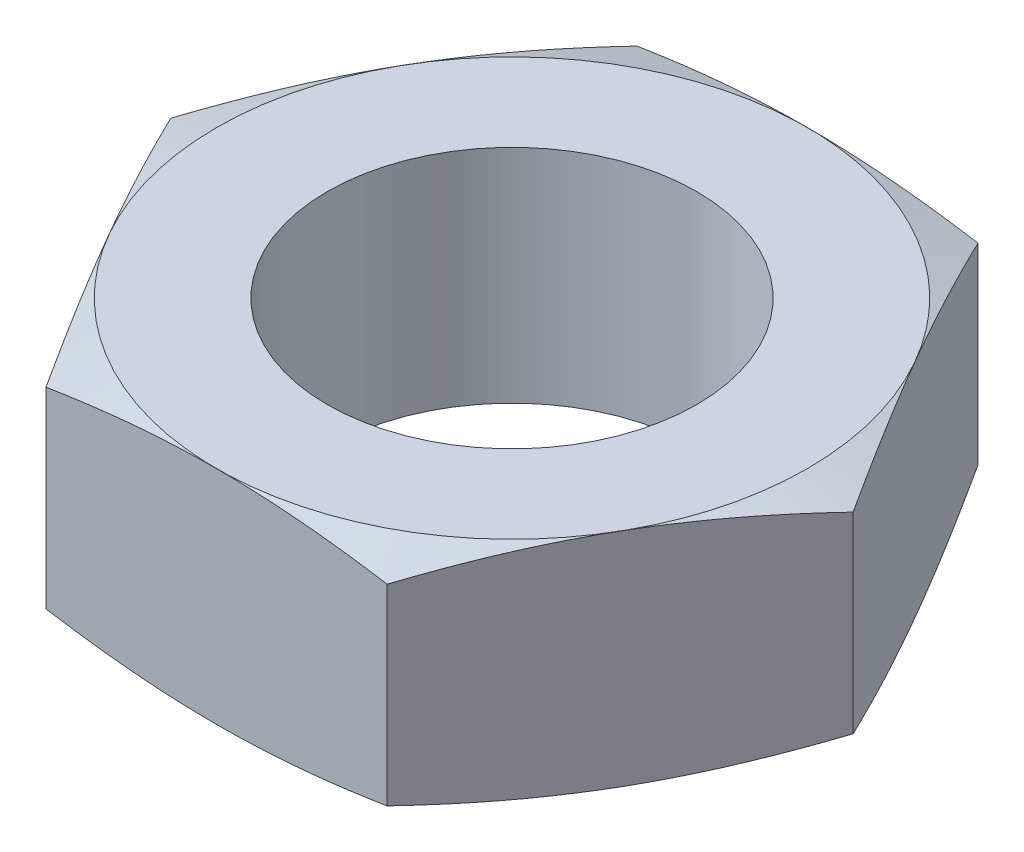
ISO-10303-21;
HEADER;
FILE_DESCRIPTION(('STEP AP214'),'2;1');
FILE_NAME('part.step','',(''),(''),'','','');
FILE_SCHEMA(('AUTOMOTIVE_DESIGN { 1 0 10303 214 1 1 1 1 }'));
ENDSEC;
DATA;
#1=APPLICATION_CONTEXT('core data for automotive mechanical design processes');
#2=APPLICATION_PROTOCOL_DEFINITION('international standard','automotive_design',2000,#1);
#3=PRODUCT_CONTEXT('',#1,'mechanical');
#4=PRODUCT('Part','Part','',(#3));
#5=PRODUCT_RELATED_PRODUCT_CATEGORY('part','',(#4));
#6=PRODUCT_DEFINITION_FORMATION('','',#4);
#7=PRODUCT_DEFINITION_CONTEXT('part definition',#1,'design');
#8=PRODUCT_DEFINITION('design','',#6,#7);
#9=PRODUCT_DEFINITION_SHAPE('','',#8);
#10=(LENGTH_UNIT() NAMED_UNIT(*) SI_UNIT(.MILLI.,.METRE.));
#11=(NAMED_UNIT(*) PLANE_ANGLE_UNIT() SI_UNIT($,.RADIAN.));
#12=(NAMED_UNIT(*) SI_UNIT($,.STERADIAN.) SOLID_ANGLE_UNIT());
#13=UNCERTAINTY_MEASURE_WITH_UNIT(LENGTH_MEASURE(1.E-05),#10,'distance_accuracy_value','');
#14=(GEOMETRIC_REPRESENTATION_CONTEXT(3) GLOBAL_UNCERTAINTY_ASSIGNED_CONTEXT((#13)) GLOBAL_UNIT_ASSIGNED_CONTEXT((#10,
#11,#12)) REPRESENTATION_CONTEXT('',''));
#15=CARTESIAN_POINT('',(0.,0.,0.));
#16=DIRECTION('',(0.,0.,1.));
#17=DIRECTION('',(1.,0.,0.));
#18=AXIS2_PLACEMENT_3D('',#15,#16,#17);
#19=CARTESIAN_POINT('',(-7.33234841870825,4.7625,0.));
#20=DIRECTION('',(0.,1.,0.));
#21=DIRECTION('',(0.,0.,1.));
#22=AXIS2_PLACEMENT_3D('',#19,#20,#21);
#23=PLANE('',#22);
#24=CARTESIAN_POINT('',(0.,4.76249999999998,0.));
#25=DIRECTION('',(0.,-1.,0.));
#26=DIRECTION('',(1.,0.,0.));
#27=AXIS2_PLACEMENT_3D('',#24,#25,#26);
#28=CIRCLE('',#27,6.34936841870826);
#29=CARTESIAN_POINT('',(6.34936841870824,4.7625,0.));
#30=VERTEX_POINT('',#29);
#31=EDGE_CURVE('E105',#30,#30,#28,.T.);
#32=ORIENTED_EDGE('',*,*,#31,.F.);
#33=EDGE_LOOP('',(#32));
#34=FACE_BOUND('',#33,.T.);
#35=CARTESIAN_POINT('',(0.,4.7625,0.));
#36=DIRECTION('',(0.,1.,0.));
#37=DIRECTION('',(0.,0.,1.));
#38=AXIS2_PLACEMENT_3D('',#35,#36,#37);
#39=CIRCLE('',#38,3.96875);
#40=CARTESIAN_POINT('',(0.,4.7625,-3.96875));
#41=VERTEX_POINT('',#40);
#42=EDGE_CURVE('E206',#41,#41,#39,.T.);
#43=ORIENTED_EDGE('',*,*,#42,.F.);
#44=EDGE_LOOP('',(#43));
#45=FACE_BOUND('',#44,.T.);
#46=ADVANCED_FACE('F32',(#34,#45),#23,.T.);
#47=CARTESIAN_POINT('',(-7.33234841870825,0.,0.));
#48=DIRECTION('',(0.,1.,0.));
#49=DIRECTION('',(0.,0.,1.));
#50=AXIS2_PLACEMENT_3D('',#47,#48,#49);
#51=PLANE('',#50);
#52=CARTESIAN_POINT('',(0.,0.,0.));
#53=DIRECTION('',(0.,-1.,0.));
#54=DIRECTION('',(1.,0.,0.));
#55=AXIS2_PLACEMENT_3D('',#52,#53,#54);
#56=CIRCLE('',#55,6.34936841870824);
#57=CARTESIAN_POINT('',(6.34936841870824,0.,0.));
#58=VERTEX_POINT('',#57);
#59=EDGE_CURVE('E234',#58,#58,#56,.T.);
#60=ORIENTED_EDGE('',*,*,#59,.T.);
#61=EDGE_LOOP('',(#60));
#62=FACE_BOUND('',#61,.T.);
#63=CARTESIAN_POINT('',(0.,0.,0.));
#64=DIRECTION('',(0.,1.,0.));
#65=DIRECTION('',(0.,0.,1.));
#66=AXIS2_PLACEMENT_3D('',#63,#64,#65);
#67=CIRCLE('',#66,3.96875);
#68=CARTESIAN_POINT('',(0.,0.,-3.96875));
#69=VERTEX_POINT('',#68);
#70=EDGE_CURVE('E205',#69,#69,#67,.T.);
#71=ORIENTED_EDGE('',*,*,#70,.T.);
#72=EDGE_LOOP('',(#71));
#73=FACE_BOUND('',#72,.T.);
#74=ADVANCED_FACE('F135',(#62,#73),#51,.F.);
#75=CARTESIAN_POINT('',(-3.66617420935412,4.7625,-6.35000000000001));
#76=DIRECTION('',(0.866025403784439,0.,0.5));
#77=DIRECTION('',(0.5,0.,-0.866025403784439));
#78=AXIS2_PLACEMENT_3D('',#75,#76,#77);
#79=PLANE('',#78);
#80=DIRECTION('',(0.,-1.,0.));
#81=VECTOR('',#80,1.);
#82=CARTESIAN_POINT('',(-7.33234841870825,4.7625,0.));
#83=LINE('',#82,#81);
#84=CARTESIAN_POINT('',(-7.33234841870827,4.44499999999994,0.));
#85=VERTEX_POINT('',#84);
#86=CARTESIAN_POINT('',(-7.33234841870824,0.317499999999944,0.));
#87=VERTEX_POINT('',#86);
#88=EDGE_CURVE('E119',#85,#87,#83,.T.);
#89=ORIENTED_EDGE('',*,*,#88,.F.);
#90=CARTESIAN_POINT('',(-7.33246388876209,4.44496270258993,0.000200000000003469));
#91=CARTESIAN_POINT('',(-7.1804349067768,4.49408731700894,-0.26312192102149));
#92=CARTESIAN_POINT('',(-7.02800846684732,4.53873297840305,-0.527132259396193));
#93=CARTESIAN_POINT('',(-6.72237428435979,4.61722964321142,-1.05650619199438));
#94=CARTESIAN_POINT('',(-6.56916612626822,4.65107412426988,-1.32187050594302));
#95=CARTESIAN_POINT('',(-6.26331249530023,4.70586252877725,-1.851624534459));
#96=CARTESIAN_POINT('',(-6.1106713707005,4.72690094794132,-2.11600671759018));
#97=CARTESIAN_POINT('',(-5.80510720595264,4.75511568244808,-2.64525937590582));
#98=CARTESIAN_POINT('',(-5.65218425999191,4.76229600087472,-2.91012968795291));
#99=CARTESIAN_POINT('',(-5.34633836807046,4.76229600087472,-3.4398703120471));
#100=CARTESIAN_POINT('',(-5.19341542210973,4.75511568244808,-3.70474062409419));
#101=CARTESIAN_POINT('',(-4.88785125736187,4.72690094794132,-4.23399328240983));
#102=CARTESIAN_POINT('',(-4.73521013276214,4.70586252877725,-4.49837546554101));
#103=CARTESIAN_POINT('',(-4.42935650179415,4.65107412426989,-5.02812949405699));
#104=CARTESIAN_POINT('',(-4.27614834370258,4.61722964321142,-5.29349380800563));
#105=CARTESIAN_POINT('',(-3.97051416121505,4.53873297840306,-5.82286774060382));
#106=CARTESIAN_POINT('',(-3.81808772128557,4.49408731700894,-6.08687807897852));
#107=CARTESIAN_POINT('',(-3.66605873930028,4.44496270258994,-6.35020000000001));
#108=B_SPLINE_CURVE_WITH_KNOTS('',3,(#90,#91,#92,#93,#94,#95,#96,#97,#98,#99,#100,#101,#102,
#103,#104,#105,#106,#107),.UNSPECIFIED.,.F.,.F.,(4,2,2,2,2,2,2,2,4),(0.,0.924075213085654,
1.848707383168,2.76643127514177,3.68389003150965,4.60134878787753,5.51907267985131,
6.44370484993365,7.3677800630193),.UNSPECIFIED.);
#109=CARTESIAN_POINT('',(-3.66617420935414,4.44499999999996,-6.35000000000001));
#110=VERTEX_POINT('',#109);
#111=EDGE_CURVE('E177',#85,#110,#108,.T.);
#112=ORIENTED_EDGE('',*,*,#111,.T.);
#113=DIRECTION('',(0.,-1.,0.));
#114=VECTOR('',#113,1.);
#115=CARTESIAN_POINT('',(-3.66617420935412,4.7625,-6.35000000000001));
#116=LINE('',#115,#114);
#117=CARTESIAN_POINT('',(-3.66617420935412,0.317500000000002,-6.35000000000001));
#118=VERTEX_POINT('',#117);
#119=EDGE_CURVE('E60',#110,#118,#116,.T.);
#120=ORIENTED_EDGE('',*,*,#119,.T.);
#121=CARTESIAN_POINT('',(-3.66605873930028,0.317537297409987,-6.35020000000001));
#122=CARTESIAN_POINT('',(-3.81808772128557,0.268412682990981,-6.08687807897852));
#123=CARTESIAN_POINT('',(-3.97051416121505,0.223767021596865,-5.82286774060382));
#124=CARTESIAN_POINT('',(-4.27614834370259,0.145270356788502,-5.29349380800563));
#125=CARTESIAN_POINT('',(-4.42935650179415,0.111425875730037,-5.02812949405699));
#126=CARTESIAN_POINT('',(-4.73521013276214,0.0566374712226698,-4.49837546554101));
#127=CARTESIAN_POINT('',(-4.88785125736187,0.0355990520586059,-4.23399328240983));
#128=CARTESIAN_POINT('',(-5.19341542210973,0.0073843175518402,-3.70474062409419));
#129=CARTESIAN_POINT('',(-5.34633836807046,0.000203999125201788,-3.4398703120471));
#130=CARTESIAN_POINT('',(-5.65218425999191,0.000203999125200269,-2.91012968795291));
#131=CARTESIAN_POINT('',(-5.80510720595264,0.00738431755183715,-2.64525937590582));
#132=CARTESIAN_POINT('',(-6.1106713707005,0.0355990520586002,-2.11600671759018));
#133=CARTESIAN_POINT('',(-6.26331249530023,0.056637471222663,-1.851624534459));
#134=CARTESIAN_POINT('',(-6.56916612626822,0.111425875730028,-1.32187050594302));
#135=CARTESIAN_POINT('',(-6.72237428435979,0.145270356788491,-1.05650619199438));
#136=CARTESIAN_POINT('',(-7.02800846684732,0.223767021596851,-0.527132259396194));
#137=CARTESIAN_POINT('',(-7.1804349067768,0.268412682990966,-0.263121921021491));
#138=CARTESIAN_POINT('',(-7.33246388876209,0.317537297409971,0.000200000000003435));
#139=B_SPLINE_CURVE_WITH_KNOTS('',3,(#121,#122,#123,#124,#125,#126,#127,#128,#129,#130,#131,
#132,#133,#134,#135,#136,#137,#138),.UNSPECIFIED.,.F.,.F.,(4,2,2,2,2,2,2,2,4),(0.,
0.924075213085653,1.848707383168,2.76643127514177,3.68389003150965,4.60134878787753,
5.5190726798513,6.44370484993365,7.3677800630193),.UNSPECIFIED.);
#140=EDGE_CURVE('E196',#118,#87,#139,.T.);
#141=ORIENTED_EDGE('',*,*,#140,.T.);
#142=EDGE_LOOP('',(#89,#112,#120,#141));
#143=FACE_BOUND('',#142,.T.);
#144=ADVANCED_FACE('F34',(#143),#79,.F.);
#145=CARTESIAN_POINT('',(-7.33234841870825,4.7625,0.));
#146=DIRECTION('',(0.866025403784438,0.,-0.5));
#147=DIRECTION('',(-0.5,0.,-0.866025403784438));
#148=AXIS2_PLACEMENT_3D('',#145,#146,#147);
#149=PLANE('',#148);
#150=DIRECTION('',(0.,-1.,0.));
#151=VECTOR('',#150,1.);
#152=CARTESIAN_POINT('',(-3.66617420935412,4.7625,6.35000000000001));
#153=LINE('',#152,#151);
#154=CARTESIAN_POINT('',(-3.66617420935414,4.44499999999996,6.35000000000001));
#155=VERTEX_POINT('',#154);
#156=CARTESIAN_POINT('',(-3.6661742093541,0.317499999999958,6.35000000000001));
#157=VERTEX_POINT('',#156);
#158=EDGE_CURVE('E113',#155,#157,#153,.T.);
#159=ORIENTED_EDGE('',*,*,#158,.F.);
#160=CARTESIAN_POINT('',(-3.66605873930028,4.44496270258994,6.35020000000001));
#161=CARTESIAN_POINT('',(-3.81808772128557,4.49408731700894,6.08687807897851));
#162=CARTESIAN_POINT('',(-3.97051416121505,4.53873297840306,5.82286774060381));
#163=CARTESIAN_POINT('',(-4.27614834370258,4.61722964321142,5.29349380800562));
#164=CARTESIAN_POINT('',(-4.42935650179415,4.65107412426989,5.02812949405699));
#165=CARTESIAN_POINT('',(-4.73521013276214,4.70586252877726,4.49837546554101));
#166=CARTESIAN_POINT('',(-4.88785125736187,4.72690094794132,4.23399328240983));
#167=CARTESIAN_POINT('',(-5.19341542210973,4.75511568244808,3.70474062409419));
#168=CARTESIAN_POINT('',(-5.34633836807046,4.76229600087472,3.4398703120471));
#169=CARTESIAN_POINT('',(-5.65218425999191,4.76229600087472,2.91012968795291));
#170=CARTESIAN_POINT('',(-5.80510720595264,4.75511568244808,2.64525937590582));
#171=CARTESIAN_POINT('',(-6.11067137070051,4.72690094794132,2.11600671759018));
#172=CARTESIAN_POINT('',(-6.26331249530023,4.70586252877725,1.851624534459));
#173=CARTESIAN_POINT('',(-6.56916612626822,4.65107412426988,1.32187050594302));
#174=CARTESIAN_POINT('',(-6.72237428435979,4.61722964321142,1.05650619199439));
#175=CARTESIAN_POINT('',(-7.02800846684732,4.53873297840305,0.5271322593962));
#176=CARTESIAN_POINT('',(-7.1804349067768,4.49408731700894,0.263121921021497));
#177=CARTESIAN_POINT('',(-7.33246388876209,4.44496270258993,-0.000199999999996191));
#178=B_SPLINE_CURVE_WITH_KNOTS('',3,(#160,#161,#162,#163,#164,#165,#166,#167,#168,#169,#170,
#171,#172,#173,#174,#175,#176,#177),.UNSPECIFIED.,.F.,.F.,(4,2,2,2,2,2,2,2,4),(0.,
0.924075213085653,1.848707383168,2.76643127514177,3.68389003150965,4.60134878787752,
5.5190726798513,6.44370484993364,7.36778006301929),.UNSPECIFIED.);
#179=EDGE_CURVE('E172',#155,#85,#178,.T.);
#180=ORIENTED_EDGE('',*,*,#179,.T.);
#181=ORIENTED_EDGE('',*,*,#88,.T.);
#182=CARTESIAN_POINT('',(-7.33246388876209,0.317537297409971,-0.000199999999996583));
#183=CARTESIAN_POINT('',(-7.1804349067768,0.268412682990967,0.263121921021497));
#184=CARTESIAN_POINT('',(-7.02800846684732,0.223767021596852,0.5271322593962));
#185=CARTESIAN_POINT('',(-6.72237428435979,0.145270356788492,1.05650619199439));
#186=CARTESIAN_POINT('',(-6.56916612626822,0.111425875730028,1.32187050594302));
#187=CARTESIAN_POINT('',(-6.26331249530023,0.0566374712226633,1.851624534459));
#188=CARTESIAN_POINT('',(-6.1106713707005,0.0355990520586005,2.11600671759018));
#189=CARTESIAN_POINT('',(-5.80510720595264,0.00738431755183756,2.64525937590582));
#190=CARTESIAN_POINT('',(-5.65218425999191,0.000203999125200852,2.91012968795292));
#191=CARTESIAN_POINT('',(-5.34633836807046,0.000203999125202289,3.4398703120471));
#192=CARTESIAN_POINT('',(-5.19341542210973,0.00738431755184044,3.70474062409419));
#193=CARTESIAN_POINT('',(-4.88785125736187,0.0355990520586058,4.23399328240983));
#194=CARTESIAN_POINT('',(-4.73521013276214,0.0566374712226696,4.49837546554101));
#195=CARTESIAN_POINT('',(-4.42935650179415,0.111425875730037,5.02812949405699));
#196=CARTESIAN_POINT('',(-4.27614834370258,0.145270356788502,5.29349380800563));
#197=CARTESIAN_POINT('',(-3.97051416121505,0.223767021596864,5.82286774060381));
#198=CARTESIAN_POINT('',(-3.81808772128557,0.268412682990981,6.08687807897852));
#199=CARTESIAN_POINT('',(-3.66605873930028,0.317537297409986,6.35020000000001));
#200=B_SPLINE_CURVE_WITH_KNOTS('',3,(#182,#183,#184,#185,#186,#187,#188,#189,#190,#191,#192,
#193,#194,#195,#196,#197,#198,#199),.UNSPECIFIED.,.F.,.F.,(4,2,2,2,2,2,2,2,4),(0.,
0.924075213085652,1.848707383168,2.76643127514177,3.68389003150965,4.60134878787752,
5.5190726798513,6.44370484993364,7.36778006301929),.UNSPECIFIED.);
#201=EDGE_CURVE('E189',#87,#157,#200,.T.);
#202=ORIENTED_EDGE('',*,*,#201,.T.);
#203=EDGE_LOOP('',(#159,#180,#181,#202));
#204=FACE_BOUND('',#203,.T.);
#205=ADVANCED_FACE('F181',(#204),#149,.F.);
#206=CARTESIAN_POINT('',(-3.66617420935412,4.7625,6.35000000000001));
#207=DIRECTION('',(0.,0.,-1.));
#208=DIRECTION('',(-1.,0.,0.));
#209=AXIS2_PLACEMENT_3D('',#206,#207,#208);
#210=PLANE('',#209);
#211=DIRECTION('',(0.,-1.,0.));
#212=VECTOR('',#211,1.);
#213=CARTESIAN_POINT('',(3.66617420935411,4.7625,6.35000000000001));
#214=LINE('',#213,#212);
#215=CARTESIAN_POINT('',(3.66617420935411,4.44499999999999,6.35000000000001));
#216=VERTEX_POINT('',#215);
#217=CARTESIAN_POINT('',(3.66617420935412,0.317499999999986,6.35));
#218=VERTEX_POINT('',#217);
#219=EDGE_CURVE('E111',#216,#218,#214,.T.);
#220=ORIENTED_EDGE('',*,*,#219,.F.);
#221=CARTESIAN_POINT('',(-9.70088606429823,3.06837421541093,6.35000000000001));
#222=CARTESIAN_POINT('',(-9.41304842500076,3.1461404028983,6.35000000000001));
#223=CARTESIAN_POINT('',(-9.12495537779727,3.2229783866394,6.35000000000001));
#224=CARTESIAN_POINT('',(-8.54813073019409,3.3742894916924,6.35000000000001));
#225=CARTESIAN_POINT('',(-8.25939909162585,3.4487624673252,6.35000000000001));
#226=CARTESIAN_POINT('',(-7.68079126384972,3.59492990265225,6.35000000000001));
#227=CARTESIAN_POINT('',(-7.39091402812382,3.66662023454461,6.35000000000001));
#228=CARTESIAN_POINT('',(-6.81029635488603,3.8064136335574,6.35000000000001));
#229=CARTESIAN_POINT('',(-6.51955592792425,3.87451674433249,6.35000000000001));
#230=CARTESIAN_POINT('',(-5.94044694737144,4.00549584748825,6.35000000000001));
#231=CARTESIAN_POINT('',(-5.65209011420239,4.06842340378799,6.35000000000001));
#232=CARTESIAN_POINT('',(-5.07424781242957,4.18885352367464,6.35000000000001));
#233=CARTESIAN_POINT('',(-4.78476237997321,4.24635625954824,6.35000000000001));
#234=CARTESIAN_POINT('',(-4.20457649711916,4.35462283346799,6.35000000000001));
#235=CARTESIAN_POINT('',(-3.91387627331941,4.4053878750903,6.35000000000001));
#236=CARTESIAN_POINT('',(-3.33113753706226,4.4986533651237,6.35000000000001));
#237=CARTESIAN_POINT('',(-3.03909902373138,4.54115380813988,6.35000000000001));
#238=CARTESIAN_POINT('',(-2.45219008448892,4.61640389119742,6.35000000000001));
#239=CARTESIAN_POINT('',(-2.15731284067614,4.64910115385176,6.35000000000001));
#240=CARTESIAN_POINT('',(-1.56648565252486,4.70279155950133,6.35000000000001));
#241=CARTESIAN_POINT('',(-1.27053574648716,4.72378511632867,6.35000000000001));
#242=CARTESIAN_POINT('',(-0.678189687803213,4.75279679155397,6.35000000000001));
#243=CARTESIAN_POINT('',(-0.381793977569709,4.76082375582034,6.35000000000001));
#244=CARTESIAN_POINT('',(0.211056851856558,4.76339756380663,6.35000000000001));
#245=CARTESIAN_POINT('',(0.507511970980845,4.7579444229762,6.35000000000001));
#246=CARTESIAN_POINT('',(1.1014139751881,4.7338603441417,6.35000000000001));
#247=CARTESIAN_POINT('',(1.3988580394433,4.71516126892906,6.35000000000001));
#248=CARTESIAN_POINT('',(1.99272960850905,4.66567425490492,6.35000000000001));
#249=CARTESIAN_POINT('',(2.28915707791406,4.6348858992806,6.35000000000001));
#250=CARTESIAN_POINT('',(2.88100929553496,4.56281297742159,6.35000000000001));
#251=CARTESIAN_POINT('',(3.17643276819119,4.52151810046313,6.35000000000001));
#252=CARTESIAN_POINT('',(3.76591108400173,4.4301940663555,6.35000000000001));
#253=CARTESIAN_POINT('',(4.05996592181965,4.38016487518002,6.35000000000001));
#254=CARTESIAN_POINT('',(4.62749518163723,4.27651251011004,6.35000000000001));
#255=CARTESIAN_POINT('',(4.90105296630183,4.2233411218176,6.35000000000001));
#256=CARTESIAN_POINT('',(5.44713820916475,4.1119237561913,6.35000000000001));
#257=CARTESIAN_POINT('',(5.71966562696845,4.05367758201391,6.35000000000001));
#258=CARTESIAN_POINT('',(6.26383583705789,3.93305170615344,6.35000000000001));
#259=CARTESIAN_POINT('',(6.53547851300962,3.87067148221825,6.35000000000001));
#260=CARTESIAN_POINT('',(7.0779702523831,3.74254270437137,6.35000000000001));
#261=CARTESIAN_POINT('',(7.34881930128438,3.6767940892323,6.35000000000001));
#262=CARTESIAN_POINT('',(8.16049374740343,3.47541335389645,6.35000000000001));
#263=CARTESIAN_POINT('',(8.70030038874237,3.33567946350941,6.35000000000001));
#264=CARTESIAN_POINT('',(9.77787882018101,3.04882513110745,6.35000000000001));
#265=CARTESIAN_POINT('',(10.3156507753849,2.90170530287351,6.35000000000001));
#266=CARTESIAN_POINT('',(11.3823067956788,2.6043379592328,6.35000000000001));
#267=CARTESIAN_POINT('',(11.911210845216,2.45416193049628,6.35000000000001));
#268=CARTESIAN_POINT('',(12.9679759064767,2.15014426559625,6.35000000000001));
#269=CARTESIAN_POINT('',(13.495836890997,1.99630253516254,6.35000000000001));
#270=CARTESIAN_POINT('',(14.5498743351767,1.68616937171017,6.35000000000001));
#271=CARTESIAN_POINT('',(15.0760521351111,1.52988248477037,6.35000000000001));
#272=CARTESIAN_POINT('',(16.1277584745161,1.21522530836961,6.35000000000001));
#273=CARTESIAN_POINT('',(16.6532870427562,1.05685511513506,6.35000000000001));
#274=CARTESIAN_POINT('',(17.1785887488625,0.897744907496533,6.35000000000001));
#275=B_SPLINE_CURVE_WITH_KNOTS('',3,(#221,#222,#223,#224,#225,#226,#227,#228,#229,#230,#231,
#232,#233,#234,#235,#236,#237,#238,#239,#240,#241,#242,#243,#244,#245,#246,#247,#248,#249,#250,
#251,#252,#253,#254,#255,#256,#257,#258,#259,#260,#261,#262,#263,#264,#265,#266,#267,#268,#269,
#270,#271,#272,#273,#274),.UNSPECIFIED.,.F.,.F.,(4,2,2,2,2,2,2,2,2,2,2,2,2,2,2,2,2,2,2,2,2,2,2,
2,2,2,4),(0.,0.894478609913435,1.78901221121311,2.68482566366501,3.58062821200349,
4.46601652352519,5.35137670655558,6.23657852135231,7.12178091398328,8.01163185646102,
8.90145133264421,9.79066351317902,10.6798746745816,11.5736934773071,12.4675430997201,
13.3622733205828,14.2570070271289,15.0929822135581,15.9289898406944,16.7651032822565,
17.6012319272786,19.2739384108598,20.9465061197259,22.5959210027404,24.2453783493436,
25.8920666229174,27.5386791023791),.UNSPECIFIED.);
#276=EDGE_CURVE('E93',#216,#155,#275,.F.);
#277=ORIENTED_EDGE('',*,*,#276,.T.);
#278=ORIENTED_EDGE('',*,*,#158,.T.);
#279=CARTESIAN_POINT('',(-9.70088606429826,1.69412578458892,6.35000000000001));
#280=CARTESIAN_POINT('',(-9.41304842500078,1.61635959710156,6.35000000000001));
#281=CARTESIAN_POINT('',(-9.1249553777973,1.53952161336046,6.35000000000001));
#282=CARTESIAN_POINT('',(-8.54813073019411,1.38821050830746,6.35000000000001));
#283=CARTESIAN_POINT('',(-8.25939909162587,1.31373753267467,6.35000000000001));
#284=CARTESIAN_POINT('',(-7.68079126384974,1.16757009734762,6.35000000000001));
#285=CARTESIAN_POINT('',(-7.39091402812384,1.09587976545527,6.35000000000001));
#286=CARTESIAN_POINT('',(-6.81029635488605,0.956086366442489,6.35000000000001));
#287=CARTESIAN_POINT('',(-6.51955592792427,0.887983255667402,6.35000000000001));
#288=CARTESIAN_POINT('',(-5.94044694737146,0.757004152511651,6.35000000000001));
#289=CARTESIAN_POINT('',(-5.65209011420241,0.694076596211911,6.35000000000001));
#290=CARTESIAN_POINT('',(-5.07424781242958,0.57364647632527,6.35000000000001));
#291=CARTESIAN_POINT('',(-4.78476237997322,0.516143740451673,6.35000000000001));
#292=CARTESIAN_POINT('',(-4.20457649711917,0.407877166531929,6.35000000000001));
#293=CARTESIAN_POINT('',(-3.91387627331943,0.357112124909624,6.35000000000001));
#294=CARTESIAN_POINT('',(-3.33113753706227,0.263846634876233,6.35000000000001));
#295=CARTESIAN_POINT('',(-3.03909902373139,0.221346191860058,6.35000000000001));
#296=CARTESIAN_POINT('',(-2.45219008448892,0.146096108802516,6.35000000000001));
#297=CARTESIAN_POINT('',(-2.15731284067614,0.113398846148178,6.35000000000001));
#298=CARTESIAN_POINT('',(-1.56648565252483,0.0597084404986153,6.35000000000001));
#299=CARTESIAN_POINT('',(-1.27053574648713,0.0387148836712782,6.35000000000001));
#300=CARTESIAN_POINT('',(-0.678189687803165,0.00970320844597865,6.35000000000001));
#301=CARTESIAN_POINT('',(-0.381793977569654,0.00167624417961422,6.35000000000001));
#302=CARTESIAN_POINT('',(0.211056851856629,-0.000897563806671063,6.35000000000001));
#303=CARTESIAN_POINT('',(0.507511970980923,0.00455557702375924,6.35000000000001));
#304=CARTESIAN_POINT('',(1.1014139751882,0.0286396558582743,6.35000000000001));
#305=CARTESIAN_POINT('',(1.39885803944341,0.0473387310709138,6.35000000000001));
#306=CARTESIAN_POINT('',(1.99272960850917,0.0968257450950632,6.35000000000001));
#307=CARTESIAN_POINT('',(2.28915707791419,0.127614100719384,6.35000000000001));
#308=CARTESIAN_POINT('',(2.8810092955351,0.199687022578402,6.35000000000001));
#309=CARTESIAN_POINT('',(3.17643276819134,0.240981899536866,6.35000000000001));
#310=CARTESIAN_POINT('',(3.76591108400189,0.3323059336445,6.35000000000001));
#311=CARTESIAN_POINT('',(4.05996592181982,0.382335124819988,6.35000000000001));
#312=CARTESIAN_POINT('',(4.62749518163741,0.485987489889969,6.35000000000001));
#313=CARTESIAN_POINT('',(4.90105296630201,0.539158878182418,6.35000000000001));
#314=CARTESIAN_POINT('',(5.44713820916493,0.650576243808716,6.35000000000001));
#315=CARTESIAN_POINT('',(5.71966562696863,0.708822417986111,6.35000000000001));
#316=CARTESIAN_POINT('',(6.26383583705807,0.829448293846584,6.35000000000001));
#317=CARTESIAN_POINT('',(6.5354785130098,0.89182851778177,6.35000000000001));
#318=CARTESIAN_POINT('',(7.07797025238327,1.01995729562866,6.35000000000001));
#319=CARTESIAN_POINT('',(7.34881930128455,1.08570591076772,6.35000000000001));
#320=CARTESIAN_POINT('',(8.1604937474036,1.28708664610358,6.35000000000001));
#321=CARTESIAN_POINT('',(8.70030038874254,1.42682053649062,6.35000000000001));
#322=CARTESIAN_POINT('',(9.77787882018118,1.71367486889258,6.35000000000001));
#323=CARTESIAN_POINT('',(10.3156507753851,1.86079469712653,6.35000000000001));
#324=CARTESIAN_POINT('',(11.382306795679,2.15816204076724,6.35000000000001));
#325=CARTESIAN_POINT('',(11.9112108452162,2.30833806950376,6.35000000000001));
#326=CARTESIAN_POINT('',(12.9679759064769,2.61235573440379,6.35000000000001));
#327=CARTESIAN_POINT('',(13.4958368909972,2.7661974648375,6.35000000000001));
#328=CARTESIAN_POINT('',(14.5498743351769,3.07633062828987,6.35000000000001));
#329=CARTESIAN_POINT('',(15.0760521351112,3.23261751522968,6.35000000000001));
#330=CARTESIAN_POINT('',(16.1277584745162,3.54727469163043,6.35000000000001));
#331=CARTESIAN_POINT('',(16.6532870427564,3.70564488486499,6.35000000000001));
#332=CARTESIAN_POINT('',(17.1785887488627,3.86475509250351,6.35000000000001));
#333=B_SPLINE_CURVE_WITH_KNOTS('',3,(#279,#280,#281,#282,#283,#284,#285,#286,#287,#288,#289,
#290,#291,#292,#293,#294,#295,#296,#297,#298,#299,#300,#301,#302,#303,#304,#305,#306,#307,#308,
#309,#310,#311,#312,#313,#314,#315,#316,#317,#318,#319,#320,#321,#322,#323,#324,#325,#326,#327,
#328,#329,#330,#331,#332),.UNSPECIFIED.,.F.,.F.,(4,2,2,2,2,2,2,2,2,2,2,2,2,2,2,2,2,2,2,2,2,2,2,
2,2,2,4),(0.,0.894478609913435,1.78901221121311,2.68482566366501,3.58062821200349,
4.46601652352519,5.35137670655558,6.23657852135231,7.12178091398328,8.01163185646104,
8.90145133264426,9.79066351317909,10.6798746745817,11.5736934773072,12.4675430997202,
13.3622733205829,14.2570070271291,15.0929822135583,15.9289898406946,16.7651032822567,
17.6012319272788,19.27393841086,20.9465061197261,22.5959210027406,24.2453783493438,
25.8920666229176,27.5386791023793),.UNSPECIFIED.);
#334=EDGE_CURVE('E197',#157,#218,#333,.T.);
#335=ORIENTED_EDGE('',*,*,#334,.T.);
#336=EDGE_LOOP('',(#220,#277,#278,#335));
#337=FACE_BOUND('',#336,.T.);
#338=ADVANCED_FACE('F184',(#337),#210,.F.);
#339=CARTESIAN_POINT('',(3.66617420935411,4.7625,6.35000000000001));
#340=DIRECTION('',(-0.866025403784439,0.,-0.5));
#341=DIRECTION('',(-0.5,0.,0.866025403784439));
#342=AXIS2_PLACEMENT_3D('',#339,#340,#341);
#343=PLANE('',#342);
#344=DIRECTION('',(0.,-1.,0.));
#345=VECTOR('',#344,1.);
#346=CARTESIAN_POINT('',(7.33234841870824,4.7625,0.));
#347=LINE('',#346,#345);
#348=CARTESIAN_POINT('',(7.33234841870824,4.445,0.));
#349=VERTEX_POINT('',#348);
#350=CARTESIAN_POINT('',(7.33234841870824,0.3175,0.));
#351=VERTEX_POINT('',#350);
#352=EDGE_CURVE('E102',#349,#351,#347,.T.);
#353=ORIENTED_EDGE('',*,*,#352,.F.);
#354=CARTESIAN_POINT('',(7.33246388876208,4.44496270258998,-0.000200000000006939));
#355=CARTESIAN_POINT('',(7.18043490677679,4.49408731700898,0.263121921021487));
#356=CARTESIAN_POINT('',(7.02800846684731,4.5387329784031,0.52713225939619));
#357=CARTESIAN_POINT('',(6.72237428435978,4.61722964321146,1.05650619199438));
#358=CARTESIAN_POINT('',(6.56916612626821,4.65107412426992,1.32187050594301));
#359=CARTESIAN_POINT('',(6.26331249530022,4.70586252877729,1.85162453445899));
#360=CARTESIAN_POINT('',(6.1106713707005,4.72690094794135,2.11600671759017));
#361=CARTESIAN_POINT('',(5.80510720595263,4.75511568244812,2.64525937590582));
#362=CARTESIAN_POINT('',(5.6521842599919,4.76229600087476,2.91012968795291));
#363=CARTESIAN_POINT('',(5.34633836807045,4.76229600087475,3.43987031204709));
#364=CARTESIAN_POINT('',(5.19341542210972,4.75511568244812,3.70474062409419));
#365=CARTESIAN_POINT('',(4.88785125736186,4.72690094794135,4.23399328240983));
#366=CARTESIAN_POINT('',(4.73521013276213,4.70586252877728,4.49837546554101));
#367=CARTESIAN_POINT('',(4.42935650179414,4.65107412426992,5.02812949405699));
#368=CARTESIAN_POINT('',(4.27614834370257,4.61722964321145,5.29349380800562));
#369=CARTESIAN_POINT('',(3.97051416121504,4.53873297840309,5.82286774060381));
#370=CARTESIAN_POINT('',(3.81808772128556,4.49408731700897,6.08687807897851));
#371=CARTESIAN_POINT('',(3.66605873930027,4.44496270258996,6.35020000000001));
#372=B_SPLINE_CURVE_WITH_KNOTS('',3,(#354,#355,#356,#357,#358,#359,#360,#361,#362,#363,#364,
#365,#366,#367,#368,#369,#370,#371),.UNSPECIFIED.,.F.,.F.,(4,2,2,2,2,2,2,2,4),(0.,
0.924075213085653,1.848707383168,2.76643127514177,3.68389003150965,4.60134878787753,
5.5190726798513,6.44370484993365,7.3677800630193),.UNSPECIFIED.);
#373=EDGE_CURVE('E90',#349,#216,#372,.T.);
#374=ORIENTED_EDGE('',*,*,#373,.T.);
#375=ORIENTED_EDGE('',*,*,#219,.T.);
#376=CARTESIAN_POINT('',(3.66605873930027,0.317537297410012,6.35020000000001));
#377=CARTESIAN_POINT('',(3.81808772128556,0.268412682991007,6.08687807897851));
#378=CARTESIAN_POINT('',(3.97051416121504,0.223767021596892,5.82286774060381));
#379=CARTESIAN_POINT('',(4.27614834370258,0.145270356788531,5.29349380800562));
#380=CARTESIAN_POINT('',(4.42935650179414,0.111425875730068,5.02812949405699));
#381=CARTESIAN_POINT('',(4.73521013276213,0.0566374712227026,4.49837546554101));
#382=CARTESIAN_POINT('',(4.88785125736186,0.0355990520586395,4.23399328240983));
#383=CARTESIAN_POINT('',(5.19341542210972,0.00738431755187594,3.70474062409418));
#384=CARTESIAN_POINT('',(5.34633836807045,0.000203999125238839,3.43987031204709));
#385=CARTESIAN_POINT('',(5.65218425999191,0.000203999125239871,2.91012968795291));
#386=CARTESIAN_POINT('',(5.80510720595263,0.00738431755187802,2.64525937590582));
#387=CARTESIAN_POINT('',(6.1106713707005,0.0355990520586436,2.11600671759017));
#388=CARTESIAN_POINT('',(6.26331249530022,0.0566374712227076,1.85162453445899));
#389=CARTESIAN_POINT('',(6.56916612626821,0.111425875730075,1.32187050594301));
#390=CARTESIAN_POINT('',(6.72237428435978,0.14527035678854,1.05650619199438));
#391=CARTESIAN_POINT('',(7.02800846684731,0.223767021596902,0.527132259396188));
#392=CARTESIAN_POINT('',(7.18043490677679,0.268412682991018,0.263121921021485));
#393=CARTESIAN_POINT('',(7.33246388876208,0.317537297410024,-0.000200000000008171));
#394=B_SPLINE_CURVE_WITH_KNOTS('',3,(#376,#377,#378,#379,#380,#381,#382,#383,#384,#385,#386,
#387,#388,#389,#390,#391,#392,#393),.UNSPECIFIED.,.F.,.F.,(4,2,2,2,2,2,2,2,4),(0.,
0.924075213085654,1.848707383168,2.76643127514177,3.68389003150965,4.60134878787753,
5.5190726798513,6.44370484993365,7.3677800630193),.UNSPECIFIED.);
#395=EDGE_CURVE('E110',#218,#351,#394,.T.);
#396=ORIENTED_EDGE('',*,*,#395,.T.);
#397=EDGE_LOOP('',(#353,#374,#375,#396));
#398=FACE_BOUND('',#397,.T.);
#399=ADVANCED_FACE('F108',(#398),#343,.F.);
#400=CARTESIAN_POINT('',(7.33234841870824,4.7625,0.));
#401=DIRECTION('',(-0.866025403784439,0.,0.5));
#402=DIRECTION('',(0.5,0.,0.866025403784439));
#403=AXIS2_PLACEMENT_3D('',#400,#401,#402);
#404=PLANE('',#403);
#405=DIRECTION('',(0.,-1.,0.));
#406=VECTOR('',#405,1.);
#407=CARTESIAN_POINT('',(3.66617420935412,4.7625,-6.35000000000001));
#408=LINE('',#407,#406);
#409=CARTESIAN_POINT('',(3.66617420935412,4.44499999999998,-6.35000000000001));
#410=VERTEX_POINT('',#409);
#411=CARTESIAN_POINT('',(3.66617420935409,0.317499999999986,-6.35000000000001));
#412=VERTEX_POINT('',#411);
#413=EDGE_CURVE('E104',#410,#412,#408,.T.);
#414=ORIENTED_EDGE('',*,*,#413,.F.);
#415=CARTESIAN_POINT('',(3.66605873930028,4.44496270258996,-6.35020000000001));
#416=CARTESIAN_POINT('',(3.81808772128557,4.49408731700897,-6.08687807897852));
#417=CARTESIAN_POINT('',(3.97051416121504,4.53873297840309,-5.82286774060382));
#418=CARTESIAN_POINT('',(4.27614834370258,4.61722964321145,-5.29349380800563));
#419=CARTESIAN_POINT('',(4.42935650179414,4.65107412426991,-5.02812949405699));
#420=CARTESIAN_POINT('',(4.73521013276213,4.70586252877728,-4.49837546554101));
#421=CARTESIAN_POINT('',(4.88785125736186,4.72690094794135,-4.23399328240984));
#422=CARTESIAN_POINT('',(5.19341542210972,4.75511568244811,-3.70474062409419));
#423=CARTESIAN_POINT('',(5.34633836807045,4.76229600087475,-3.4398703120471));
#424=CARTESIAN_POINT('',(5.65218425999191,4.76229600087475,-2.91012968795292));
#425=CARTESIAN_POINT('',(5.80510720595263,4.75511568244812,-2.64525937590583));
#426=CARTESIAN_POINT('',(6.1106713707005,4.72690094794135,-2.11600671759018));
#427=CARTESIAN_POINT('',(6.26331249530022,4.70586252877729,-1.851624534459));
#428=CARTESIAN_POINT('',(6.56916612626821,4.65107412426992,-1.32187050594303));
#429=CARTESIAN_POINT('',(6.72237428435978,4.61722964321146,-1.05650619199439));
#430=CARTESIAN_POINT('',(7.02800846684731,4.5387329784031,-0.527132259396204));
#431=CARTESIAN_POINT('',(7.18043490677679,4.49408731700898,-0.2631219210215));
#432=CARTESIAN_POINT('',(7.33246388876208,4.44496270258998,0.000199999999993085));
#433=B_SPLINE_CURVE_WITH_KNOTS('',3,(#415,#416,#417,#418,#419,#420,#421,#422,#423,#424,#425,
#426,#427,#428,#429,#430,#431,#432),.UNSPECIFIED.,.F.,.F.,(4,2,2,2,2,2,2,2,4),(0.,
0.924075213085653,1.848707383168,2.76643127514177,3.68389003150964,4.60134878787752,
5.5190726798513,6.44370484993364,7.36778006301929),.UNSPECIFIED.);
#434=EDGE_CURVE('E53',#410,#349,#433,.T.);
#435=ORIENTED_EDGE('',*,*,#434,.T.);
#436=ORIENTED_EDGE('',*,*,#352,.T.);
#437=CARTESIAN_POINT('',(7.33246388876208,0.317537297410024,0.000199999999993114));
#438=CARTESIAN_POINT('',(7.18043490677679,0.268412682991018,-0.2631219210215));
#439=CARTESIAN_POINT('',(7.02800846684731,0.223767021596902,-0.527132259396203));
#440=CARTESIAN_POINT('',(6.72237428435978,0.14527035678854,-1.05650619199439));
#441=CARTESIAN_POINT('',(6.56916612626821,0.111425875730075,-1.32187050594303));
#442=CARTESIAN_POINT('',(6.26331249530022,0.0566374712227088,-1.85162453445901));
#443=CARTESIAN_POINT('',(6.1106713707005,0.0355990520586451,-2.11600671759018));
#444=CARTESIAN_POINT('',(5.80510720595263,0.00738431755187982,-2.64525937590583));
#445=CARTESIAN_POINT('',(5.65218425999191,0.000203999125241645,-2.91012968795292));
#446=CARTESIAN_POINT('',(5.34633836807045,0.000203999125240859,-3.4398703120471));
#447=CARTESIAN_POINT('',(5.19341542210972,0.00738431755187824,-3.70474062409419));
#448=CARTESIAN_POINT('',(4.88785125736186,0.035599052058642,-4.23399328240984));
#449=CARTESIAN_POINT('',(4.73521013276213,0.0566374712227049,-4.49837546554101));
#450=CARTESIAN_POINT('',(4.42935650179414,0.11142587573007,-5.028129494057));
#451=CARTESIAN_POINT('',(4.27614834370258,0.145270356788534,-5.29349380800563));
#452=CARTESIAN_POINT('',(3.97051416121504,0.223767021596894,-5.82286774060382));
#453=CARTESIAN_POINT('',(3.81808772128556,0.268412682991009,-6.08687807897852));
#454=CARTESIAN_POINT('',(3.66605873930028,0.317537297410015,-6.35020000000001));
#455=B_SPLINE_CURVE_WITH_KNOTS('',3,(#437,#438,#439,#440,#441,#442,#443,#444,#445,#446,#447,
#448,#449,#450,#451,#452,#453,#454),.UNSPECIFIED.,.F.,.F.,(4,2,2,2,2,2,2,2,4),(0.,
0.924075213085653,1.848707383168,2.76643127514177,3.68389003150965,4.60134878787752,
5.5190726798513,6.44370484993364,7.36778006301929),.UNSPECIFIED.);
#456=EDGE_CURVE('E145',#351,#412,#455,.T.);
#457=ORIENTED_EDGE('',*,*,#456,.T.);
#458=EDGE_LOOP('',(#414,#435,#436,#457));
#459=FACE_BOUND('',#458,.T.);
#460=ADVANCED_FACE('F100',(#459),#404,.F.);
#461=CARTESIAN_POINT('',(3.66617420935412,4.7625,-6.35000000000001));
#462=DIRECTION('',(0.,0.,1.));
#463=DIRECTION('',(1.,0.,0.));
#464=AXIS2_PLACEMENT_3D('',#461,#462,#463);
#465=PLANE('',#464);
#466=ORIENTED_EDGE('',*,*,#119,.F.);
#467=CARTESIAN_POINT('',(-9.70088606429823,3.06837421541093,-6.35000000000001));
#468=CARTESIAN_POINT('',(-9.41304842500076,3.1461404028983,-6.35000000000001));
#469=CARTESIAN_POINT('',(-9.12495537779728,3.2229783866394,-6.35000000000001));
#470=CARTESIAN_POINT('',(-8.54813073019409,3.3742894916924,-6.35000000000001));
#471=CARTESIAN_POINT('',(-8.25939909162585,3.4487624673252,-6.35000000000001));
#472=CARTESIAN_POINT('',(-7.68079126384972,3.59492990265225,-6.35000000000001));
#473=CARTESIAN_POINT('',(-7.39091402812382,3.66662023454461,-6.35000000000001));
#474=CARTESIAN_POINT('',(-6.81029635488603,3.8064136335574,-6.35000000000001));
#475=CARTESIAN_POINT('',(-6.51955592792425,3.87451674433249,-6.35000000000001));
#476=CARTESIAN_POINT('',(-5.94044694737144,4.00549584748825,-6.35000000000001));
#477=CARTESIAN_POINT('',(-5.65209011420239,4.06842340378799,-6.35000000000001));
#478=CARTESIAN_POINT('',(-5.07424781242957,4.18885352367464,-6.35000000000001));
#479=CARTESIAN_POINT('',(-4.78476237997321,4.24635625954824,-6.35000000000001));
#480=CARTESIAN_POINT('',(-4.20457649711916,4.35462283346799,-6.35000000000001));
#481=CARTESIAN_POINT('',(-3.91387627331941,4.4053878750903,-6.35000000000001));
#482=CARTESIAN_POINT('',(-3.33113753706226,4.49865336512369,-6.35000000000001));
#483=CARTESIAN_POINT('',(-3.03909902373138,4.54115380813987,-6.35000000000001));
#484=CARTESIAN_POINT('',(-2.45219008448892,4.61640389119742,-6.35000000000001));
#485=CARTESIAN_POINT('',(-2.15731284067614,4.64910115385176,-6.35000000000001));
#486=CARTESIAN_POINT('',(-1.56648565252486,4.70279155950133,-6.35000000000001));
#487=CARTESIAN_POINT('',(-1.27053574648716,4.72378511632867,-6.35000000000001));
#488=CARTESIAN_POINT('',(-0.67818968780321,4.75279679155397,-6.35000000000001));
#489=CARTESIAN_POINT('',(-0.381793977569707,4.76082375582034,-6.35000000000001));
#490=CARTESIAN_POINT('',(0.211056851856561,4.76339756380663,-6.35000000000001));
#491=CARTESIAN_POINT('',(0.507511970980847,4.7579444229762,-6.35000000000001));
#492=CARTESIAN_POINT('',(1.10141397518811,4.73386034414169,-6.35000000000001));
#493=CARTESIAN_POINT('',(1.39885803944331,4.71516126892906,-6.35000000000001));
#494=CARTESIAN_POINT('',(1.99272960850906,4.66567425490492,-6.35000000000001));
#495=CARTESIAN_POINT('',(2.28915707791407,4.6348858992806,-6.35000000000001));
#496=CARTESIAN_POINT('',(2.88100929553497,4.56281297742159,-6.35000000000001));
#497=CARTESIAN_POINT('',(3.1764327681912,4.52151810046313,-6.35000000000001));
#498=CARTESIAN_POINT('',(3.76591108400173,4.4301940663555,-6.35000000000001));
#499=CARTESIAN_POINT('',(4.05996592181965,4.38016487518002,-6.35000000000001));
#500=CARTESIAN_POINT('',(4.62749518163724,4.27651251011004,-6.35000000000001));
#501=CARTESIAN_POINT('',(4.90105296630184,4.22334112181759,-6.35000000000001));
#502=CARTESIAN_POINT('',(5.44713820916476,4.1119237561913,-6.35000000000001));
#503=CARTESIAN_POINT('',(5.71966562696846,4.0536775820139,-6.35000000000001));
#504=CARTESIAN_POINT('',(6.2638358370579,3.93305170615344,-6.35000000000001));
#505=CARTESIAN_POINT('',(6.53547851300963,3.87067148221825,-6.35000000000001));
#506=CARTESIAN_POINT('',(7.07797025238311,3.74254270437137,-6.35000000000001));
#507=CARTESIAN_POINT('',(7.34881930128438,3.6767940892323,-6.35000000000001));
#508=CARTESIAN_POINT('',(8.16049374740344,3.47541335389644,-6.35000000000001));
#509=CARTESIAN_POINT('',(8.70030038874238,3.3356794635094,-6.35000000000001));
#510=CARTESIAN_POINT('',(9.77787882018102,3.04882513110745,-6.35000000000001));
#511=CARTESIAN_POINT('',(10.315650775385,2.9017053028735,-6.35000000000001));
#512=CARTESIAN_POINT('',(11.3823067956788,2.60433795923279,-6.35000000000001));
#513=CARTESIAN_POINT('',(11.9112108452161,2.45416193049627,-6.35000000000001));
#514=CARTESIAN_POINT('',(12.9679759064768,2.15014426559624,-6.35000000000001));
#515=CARTESIAN_POINT('',(13.495836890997,1.99630253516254,-6.35000000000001));
#516=CARTESIAN_POINT('',(14.5498743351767,1.68616937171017,-6.35000000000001));
#517=CARTESIAN_POINT('',(15.0760521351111,1.52988248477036,-6.35000000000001));
#518=CARTESIAN_POINT('',(16.1277584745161,1.21522530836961,-6.35000000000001));
#519=CARTESIAN_POINT('',(16.6532870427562,1.05685511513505,-6.35000000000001));
#520=CARTESIAN_POINT('',(17.1785887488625,0.897744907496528,-6.35000000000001));
#521=B_SPLINE_CURVE_WITH_KNOTS('',3,(#467,#468,#469,#470,#471,#472,#473,#474,#475,#476,#477,
#478,#479,#480,#481,#482,#483,#484,#485,#486,#487,#488,#489,#490,#491,#492,#493,#494,#495,#496,
#497,#498,#499,#500,#501,#502,#503,#504,#505,#506,#507,#508,#509,#510,#511,#512,#513,#514,#515,
#516,#517,#518,#519,#520),.UNSPECIFIED.,.F.,.F.,(4,2,2,2,2,2,2,2,2,2,2,2,2,2,2,2,2,2,2,2,2,2,2,
2,2,2,4),(0.,0.894478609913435,1.78901221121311,2.68482566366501,3.5806282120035,
4.4660165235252,5.35137670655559,6.23657852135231,7.12178091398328,8.01163185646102,
8.90145133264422,9.79066351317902,10.6798746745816,11.5736934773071,12.4675430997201,
13.3622733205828,14.2570070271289,15.0929822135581,15.9289898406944,16.7651032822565,
17.6012319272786,19.2739384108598,20.9465061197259,22.5959210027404,24.2453783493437,
25.8920666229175,27.5386791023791),.UNSPECIFIED.);
#522=EDGE_CURVE('E11',#110,#410,#521,.T.);
#523=ORIENTED_EDGE('',*,*,#522,.T.);
#524=ORIENTED_EDGE('',*,*,#413,.T.);
#525=CARTESIAN_POINT('',(-9.70088606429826,1.69412578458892,-6.35000000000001));
#526=CARTESIAN_POINT('',(-9.41304842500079,1.61635959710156,-6.35000000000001));
#527=CARTESIAN_POINT('',(-9.12495537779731,1.53952161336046,-6.35000000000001));
#528=CARTESIAN_POINT('',(-8.54813073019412,1.38821050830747,-6.35000000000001));
#529=CARTESIAN_POINT('',(-8.25939909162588,1.31373753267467,-6.35000000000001));
#530=CARTESIAN_POINT('',(-7.68079126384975,1.16757009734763,-6.35000000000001));
#531=CARTESIAN_POINT('',(-7.39091402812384,1.09587976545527,-6.35000000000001));
#532=CARTESIAN_POINT('',(-6.81029635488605,0.956086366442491,-6.35000000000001));
#533=CARTESIAN_POINT('',(-6.51955592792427,0.887983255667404,-6.35000000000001));
#534=CARTESIAN_POINT('',(-5.94044694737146,0.757004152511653,-6.35000000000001));
#535=CARTESIAN_POINT('',(-5.65209011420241,0.694076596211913,-6.35000000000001));
#536=CARTESIAN_POINT('',(-5.07424781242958,0.573646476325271,-6.35000000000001));
#537=CARTESIAN_POINT('',(-4.78476237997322,0.516143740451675,-6.35000000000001));
#538=CARTESIAN_POINT('',(-4.20457649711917,0.40787716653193,-6.35000000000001));
#539=CARTESIAN_POINT('',(-3.91387627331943,0.357112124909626,-6.35000000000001));
#540=CARTESIAN_POINT('',(-3.33113753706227,0.263846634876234,-6.35000000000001));
#541=CARTESIAN_POINT('',(-3.03909902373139,0.221346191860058,-6.35000000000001));
#542=CARTESIAN_POINT('',(-2.45219008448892,0.146096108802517,-6.35000000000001));
#543=CARTESIAN_POINT('',(-2.15731284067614,0.113398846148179,-6.35000000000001));
#544=CARTESIAN_POINT('',(-1.56648565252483,0.0597084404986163,-6.35000000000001));
#545=CARTESIAN_POINT('',(-1.27053574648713,0.0387148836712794,-6.35000000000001));
#546=CARTESIAN_POINT('',(-0.678189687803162,0.00970320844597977,-6.35000000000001));
#547=CARTESIAN_POINT('',(-0.381793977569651,0.00167624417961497,-6.35000000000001));
#548=CARTESIAN_POINT('',(0.211056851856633,-0.000897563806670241,-6.35000000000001));
#549=CARTESIAN_POINT('',(0.507511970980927,0.00455557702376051,-6.35000000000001));
#550=CARTESIAN_POINT('',(1.1014139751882,0.0286396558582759,-6.35000000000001));
#551=CARTESIAN_POINT('',(1.39885803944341,0.0473387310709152,-6.35000000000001));
#552=CARTESIAN_POINT('',(1.99272960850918,0.0968257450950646,-6.35000000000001));
#553=CARTESIAN_POINT('',(2.28915707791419,0.127614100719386,-6.35000000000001));
#554=CARTESIAN_POINT('',(2.88100929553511,0.199687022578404,-6.35000000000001));
#555=CARTESIAN_POINT('',(3.17643276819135,0.240981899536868,-6.35000000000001));
#556=CARTESIAN_POINT('',(3.7659110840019,0.332305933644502,-6.35000000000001));
#557=CARTESIAN_POINT('',(4.05996592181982,0.38233512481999,-6.35000000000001));
#558=CARTESIAN_POINT('',(4.62749518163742,0.485987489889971,-6.35000000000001));
#559=CARTESIAN_POINT('',(4.90105296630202,0.539158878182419,-6.35000000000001));
#560=CARTESIAN_POINT('',(5.44713820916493,0.650576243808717,-6.35000000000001));
#561=CARTESIAN_POINT('',(5.71966562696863,0.708822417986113,-6.35000000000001));
#562=CARTESIAN_POINT('',(6.26383583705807,0.829448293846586,-6.35000000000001));
#563=CARTESIAN_POINT('',(6.5354785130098,0.891828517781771,-6.35000000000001));
#564=CARTESIAN_POINT('',(7.07797025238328,1.01995729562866,-6.35000000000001));
#565=CARTESIAN_POINT('',(7.34881930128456,1.08570591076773,-6.35000000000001));
#566=CARTESIAN_POINT('',(8.16049374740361,1.28708664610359,-6.35000000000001));
#567=CARTESIAN_POINT('',(8.70030038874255,1.42682053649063,-6.35000000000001));
#568=CARTESIAN_POINT('',(9.77787882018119,1.71367486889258,-6.35000000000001));
#569=CARTESIAN_POINT('',(10.3156507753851,1.86079469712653,-6.35000000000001));
#570=CARTESIAN_POINT('',(11.382306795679,2.15816204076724,-6.35000000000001));
#571=CARTESIAN_POINT('',(11.9112108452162,2.30833806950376,-6.35000000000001));
#572=CARTESIAN_POINT('',(12.9679759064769,2.61235573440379,-6.35000000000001));
#573=CARTESIAN_POINT('',(13.4958368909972,2.7661974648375,-6.35000000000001));
#574=CARTESIAN_POINT('',(14.5498743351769,3.07633062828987,-6.35000000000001));
#575=CARTESIAN_POINT('',(15.0760521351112,3.23261751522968,-6.35000000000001));
#576=CARTESIAN_POINT('',(16.1277584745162,3.54727469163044,-6.35000000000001));
#577=CARTESIAN_POINT('',(16.6532870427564,3.70564488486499,-6.35000000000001));
#578=CARTESIAN_POINT('',(17.1785887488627,3.86475509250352,-6.35000000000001));
#579=B_SPLINE_CURVE_WITH_KNOTS('',3,(#525,#526,#527,#528,#529,#530,#531,#532,#533,#534,#535,
#536,#537,#538,#539,#540,#541,#542,#543,#544,#545,#546,#547,#548,#549,#550,#551,#552,#553,#554,
#555,#556,#557,#558,#559,#560,#561,#562,#563,#564,#565,#566,#567,#568,#569,#570,#571,#572,#573,
#574,#575,#576,#577,#578),.UNSPECIFIED.,.F.,.F.,(4,2,2,2,2,2,2,2,2,2,2,2,2,2,2,2,2,2,2,2,2,2,2,
2,2,2,4),(0.,0.894478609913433,1.78901221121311,2.68482566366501,3.58062821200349,
4.46601652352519,5.35137670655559,6.23657852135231,7.12178091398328,8.01163185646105,
8.90145133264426,9.7906635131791,10.6798746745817,11.5736934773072,12.4675430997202,
13.3622733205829,14.2570070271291,15.0929822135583,15.9289898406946,16.7651032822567,
17.6012319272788,19.27393841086,20.9465061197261,22.5959210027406,24.2453783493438,
25.8920666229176,27.5386791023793),.UNSPECIFIED.);
#580=EDGE_CURVE('E46',#412,#118,#579,.F.);
#581=ORIENTED_EDGE('',*,*,#580,.T.);
#582=EDGE_LOOP('',(#466,#523,#524,#581));
#583=FACE_BOUND('',#582,.T.);
#584=ADVANCED_FACE('F128',(#583),#465,.F.);
#585=CARTESIAN_POINT('',(0.,4.7625,0.));
#586=DIRECTION('',(0.,-1.,0.));
#587=DIRECTION('',(0.,0.,-1.));
#588=AXIS2_PLACEMENT_3D('',#585,#586,#587);
#589=CYLINDRICAL_SURFACE('',#588,3.96875);
#590=CARTESIAN_POINT('',(0.,4.7625,-3.96875));
#591=CARTESIAN_POINT('',(0.,4.712890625,-3.96875));
#592=CARTESIAN_POINT('',(0.,4.66328125,-3.96875));
#593=CARTESIAN_POINT('',(0.,4.5640625,-3.96875));
#594=CARTESIAN_POINT('',(0.,4.514453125,-3.96875));
#595=CARTESIAN_POINT('',(0.,4.415234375,-3.96875));
#596=CARTESIAN_POINT('',(0.,4.365625,-3.96875));
#597=CARTESIAN_POINT('',(0.,4.26640625,-3.96875));
#598=CARTESIAN_POINT('',(0.,4.216796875,-3.96875));
#599=CARTESIAN_POINT('',(0.,4.117578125,-3.96875));
#600=CARTESIAN_POINT('',(0.,4.06796875,-3.96875));
#601=CARTESIAN_POINT('',(0.,3.96875,-3.96875));
#602=CARTESIAN_POINT('',(0.,3.919140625,-3.96875));
#603=CARTESIAN_POINT('',(0.,3.819921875,-3.96875));
#604=CARTESIAN_POINT('',(0.,3.7703125,-3.96875));
#605=CARTESIAN_POINT('',(0.,3.67109375,-3.96875));
#606=CARTESIAN_POINT('',(0.,3.621484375,-3.96875));
#607=CARTESIAN_POINT('',(0.,3.522265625,-3.96875));
#608=CARTESIAN_POINT('',(0.,3.47265625,-3.96875));
#609=CARTESIAN_POINT('',(0.,3.3734375,-3.96875));
#610=CARTESIAN_POINT('',(0.,3.323828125,-3.96875));
#611=CARTESIAN_POINT('',(0.,3.224609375,-3.96875));
#612=CARTESIAN_POINT('',(0.,3.175,-3.96875));
#613=CARTESIAN_POINT('',(0.,3.07578125,-3.96875));
#614=CARTESIAN_POINT('',(0.,3.026171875,-3.96875));
#615=CARTESIAN_POINT('',(0.,2.926953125,-3.96875));
#616=CARTESIAN_POINT('',(0.,2.87734375,-3.96875));
#617=CARTESIAN_POINT('',(0.,2.778125,-3.96875));
#618=CARTESIAN_POINT('',(0.,2.728515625,-3.96875));
#619=CARTESIAN_POINT('',(0.,2.629296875,-3.96875));
#620=CARTESIAN_POINT('',(0.,2.5796875,-3.96875));
#621=CARTESIAN_POINT('',(0.,2.48046875,-3.96875));
#622=CARTESIAN_POINT('',(0.,2.430859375,-3.96875));
#623=CARTESIAN_POINT('',(0.,2.331640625,-3.96875));
#624=CARTESIAN_POINT('',(0.,2.28203125,-3.96875));
#625=CARTESIAN_POINT('',(0.,2.1828125,-3.96875));
#626=CARTESIAN_POINT('',(0.,2.133203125,-3.96875));
#627=CARTESIAN_POINT('',(0.,2.033984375,-3.96875));
#628=CARTESIAN_POINT('',(0.,1.984375,-3.96875));
#629=CARTESIAN_POINT('',(0.,1.88515625,-3.96875));
#630=CARTESIAN_POINT('',(0.,1.835546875,-3.96875));
#631=CARTESIAN_POINT('',(0.,1.736328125,-3.96875));
#632=CARTESIAN_POINT('',(0.,1.68671875,-3.96875));
#633=CARTESIAN_POINT('',(0.,1.5875,-3.96875));
#634=CARTESIAN_POINT('',(0.,1.537890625,-3.96875));
#635=CARTESIAN_POINT('',(0.,1.438671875,-3.96875));
#636=CARTESIAN_POINT('',(0.,1.3890625,-3.96875));
#637=CARTESIAN_POINT('',(0.,1.28984375,-3.96875));
#638=CARTESIAN_POINT('',(0.,1.240234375,-3.96875));
#639=CARTESIAN_POINT('',(0.,1.141015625,-3.96875));
#640=CARTESIAN_POINT('',(0.,1.09140625,-3.96875));
#641=CARTESIAN_POINT('',(0.,0.9921875,-3.96875));
#642=CARTESIAN_POINT('',(0.,0.942578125,-3.96875));
#643=CARTESIAN_POINT('',(0.,0.843359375,-3.96875));
#644=CARTESIAN_POINT('',(0.,0.79375,-3.96875));
#645=CARTESIAN_POINT('',(0.,0.69453125,-3.96875));
#646=CARTESIAN_POINT('',(0.,0.644921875,-3.96875));
#647=CARTESIAN_POINT('',(0.,0.545703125,-3.96875));
#648=CARTESIAN_POINT('',(0.,0.49609375,-3.96875));
#649=CARTESIAN_POINT('',(0.,0.396875,-3.96875));
#650=CARTESIAN_POINT('',(0.,0.347265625,-3.96875));
#651=CARTESIAN_POINT('',(0.,0.248046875,-3.96875));
#652=CARTESIAN_POINT('',(0.,0.1984375,-3.96875));
#653=CARTESIAN_POINT('',(0.,0.09921875,-3.96875));
#654=CARTESIAN_POINT('',(0.,0.049609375,-3.96875));
#655=CARTESIAN_POINT('',(0.,0.,-3.96875));
#656=B_SPLINE_CURVE_WITH_KNOTS('',3,(#590,#591,#592,#593,#594,#595,#596,#597,#598,#599,#600,
#601,#602,#603,#604,#605,#606,#607,#608,#609,#610,#611,#612,#613,#614,#615,#616,#617,#618,#619,
#620,#621,#622,#623,#624,#625,#626,#627,#628,#629,#630,#631,#632,#633,#634,#635,#636,#637,#638,
#639,#640,#641,#642,#643,#644,#645,#646,#647,#648,#649,#650,#651,#652,#653,#654,#655),
.UNSPECIFIED.,.F.,.F.,(4,2,2,2,2,2,2,2,2,2,2,2,2,2,2,2,2,2,2,2,2,2,2,2,2,2,2,2,2,2,2,2,4),(0.,
0.148828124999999,0.297656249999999,0.446484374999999,0.595312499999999,0.744140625,0.89296875,
1.041796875,1.190625,1.339453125,1.48828125,1.637109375,1.7859375,1.934765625,2.08359375,
2.232421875,2.38125,2.530078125,2.67890625,2.827734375,2.9765625,3.125390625,3.27421875,
3.423046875,3.571875,3.720703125,3.86953125,4.018359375,4.1671875,4.316015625,4.46484375,
4.613671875,4.7625),.UNSPECIFIED.);
#657=EDGE_CURVE('BSEAM133',#41,#69,#656,.T.);
#658=ORIENTED_EDGE('',*,*,#42,.T.);
#659=ORIENTED_EDGE('',*,*,#70,.F.);
#660=ORIENTED_EDGE('',*,*,#657,.T.);
#661=ORIENTED_EDGE('',*,*,#657,.F.);
#662=EDGE_LOOP('',(#658,#660,#659,#661));
#663=FACE_BOUND('',#662,.T.);
#664=ADVANCED_FACE('F133',(#663),#589,.F.);
#665=CARTESIAN_POINT('',(0.,0.317499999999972,0.));
#666=DIRECTION('',(0.,1.,0.));
#667=DIRECTION('',(-1.,0.,0.));
#668=AXIS2_PLACEMENT_3D('',#665,#666,#667);
#669=CONICAL_SURFACE('',#668,7.33234841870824,1.25837676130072);
#670=ORIENTED_EDGE('',*,*,#59,.F.);
#671=EDGE_LOOP('',(#670));
#672=FACE_BOUND('',#671,.T.);
#673=ORIENTED_EDGE('',*,*,#580,.F.);
#674=ORIENTED_EDGE('',*,*,#456,.F.);
#675=ORIENTED_EDGE('',*,*,#395,.F.);
#676=ORIENTED_EDGE('',*,*,#334,.F.);
#677=ORIENTED_EDGE('',*,*,#201,.F.);
#678=ORIENTED_EDGE('',*,*,#140,.F.);
#679=EDGE_LOOP('',(#673,#674,#675,#676,#677,#678));
#680=FACE_BOUND('',#679,.T.);
#681=ADVANCED_FACE('F125',(#672,#680),#669,.T.);
#682=CARTESIAN_POINT('',(0.,4.76249999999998,0.));
#683=DIRECTION('',(0.,-1.,0.));
#684=DIRECTION('',(1.,0.,0.));
#685=AXIS2_PLACEMENT_3D('',#682,#683,#684);
#686=CONICAL_SURFACE('',#685,6.34936841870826,1.25837676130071);
#687=ORIENTED_EDGE('',*,*,#31,.T.);
#688=EDGE_LOOP('',(#687));
#689=FACE_BOUND('',#688,.T.);
#690=ORIENTED_EDGE('',*,*,#179,.F.);
#691=ORIENTED_EDGE('',*,*,#276,.F.);
#692=ORIENTED_EDGE('',*,*,#373,.F.);
#693=ORIENTED_EDGE('',*,*,#434,.F.);
#694=ORIENTED_EDGE('',*,*,#522,.F.);
#695=ORIENTED_EDGE('',*,*,#111,.F.);
#696=EDGE_LOOP('',(#690,#691,#692,#693,#694,#695));
#697=FACE_BOUND('',#696,.T.);
#698=ADVANCED_FACE('F91',(#689,#697),#686,.T.);
#699=CLOSED_SHELL('',(#46,#74,#144,#205,#338,#399,#460,#584,#664,#681,#698));
#700=MANIFOLD_SOLID_BREP('B2',#699);
#701=ADVANCED_BREP_SHAPE_REPRESENTATION('',(#18,#700),#14);
#702=SHAPE_DEFINITION_REPRESENTATION(#9,#701);
ENDSEC;
END-ISO-10303-21;
